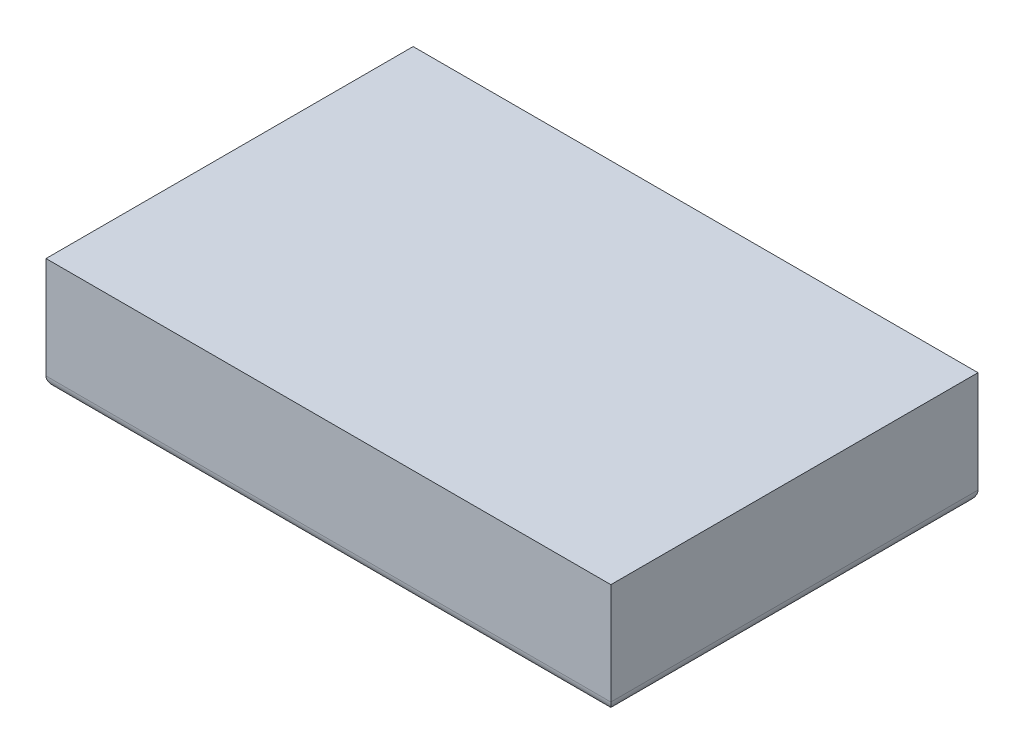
from build123d import *

# Parameters (mm, degrees)
SKETCH2_W           = 10
SKETCH2_H           = 6.5
BOSS_EXTRUDE1_DEPTH = 2
F_3D_PRINT_FILLET_R = 0.2


with BuildPart() as part:
    # Sketch2 → Boss-Extrude1 (new body)
    with BuildSketch(Plane(origin=(0, 0, 0), x_dir=(1, 0, 0), z_dir=(0, 1, 0))):
        Rectangle(SKETCH2_W, SKETCH2_H)
    extrude(amount=BOSS_EXTRUDE1_DEPTH)

    # 3D print Fillet
    f_3d_print_fillet_edges = [part.edges().sort_by_distance(p)[0] for p in [
        (0, 0, 3.25),
        (-5, 0, 0),
        (0, 0, -3.25),
        (5, 0, 0),
    ]]
    fillet(f_3d_print_fillet_edges, radius=F_3D_PRINT_FILLET_R)


solid = part.part
